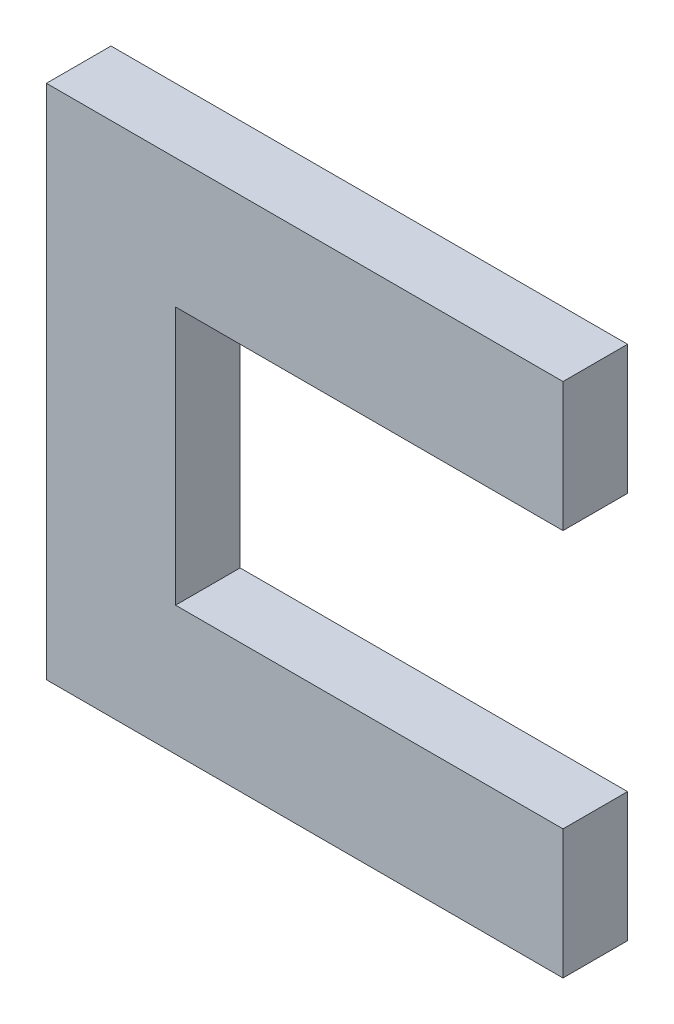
ISO-10303-21;
HEADER;
FILE_DESCRIPTION(('STEP AP214'),'2;1');
FILE_NAME('part.step','',(''),(''),'','','');
FILE_SCHEMA(('AUTOMOTIVE_DESIGN { 1 0 10303 214 1 1 1 1 }'));
ENDSEC;
DATA;
#1=APPLICATION_CONTEXT('core data for automotive mechanical design processes');
#2=APPLICATION_PROTOCOL_DEFINITION('international standard','automotive_design',2000,#1);
#3=PRODUCT_CONTEXT('',#1,'mechanical');
#4=PRODUCT('Part','Part','',(#3));
#5=PRODUCT_RELATED_PRODUCT_CATEGORY('part','',(#4));
#6=PRODUCT_DEFINITION_FORMATION('','',#4);
#7=PRODUCT_DEFINITION_CONTEXT('part definition',#1,'design');
#8=PRODUCT_DEFINITION('design','',#6,#7);
#9=PRODUCT_DEFINITION_SHAPE('','',#8);
#10=(LENGTH_UNIT() NAMED_UNIT(*) SI_UNIT(.MILLI.,.METRE.));
#11=(NAMED_UNIT(*) PLANE_ANGLE_UNIT() SI_UNIT($,.RADIAN.));
#12=(NAMED_UNIT(*) SI_UNIT($,.STERADIAN.) SOLID_ANGLE_UNIT());
#13=UNCERTAINTY_MEASURE_WITH_UNIT(LENGTH_MEASURE(1.E-05),#10,'distance_accuracy_value','');
#14=(GEOMETRIC_REPRESENTATION_CONTEXT(3) GLOBAL_UNCERTAINTY_ASSIGNED_CONTEXT((#13)) GLOBAL_UNIT_ASSIGNED_CONTEXT((#10,
#11,#12)) REPRESENTATION_CONTEXT('',''));
#15=CARTESIAN_POINT('',(0.,0.,0.));
#16=DIRECTION('',(0.,0.,1.));
#17=DIRECTION('',(1.,0.,0.));
#18=AXIS2_PLACEMENT_3D('',#15,#16,#17);
#19=CARTESIAN_POINT('',(-45.4783031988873,7.73393602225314,10.));
#20=DIRECTION('',(0.,1.,0.));
#21=DIRECTION('',(0.,0.,1.));
#22=AXIS2_PLACEMENT_3D('',#19,#20,#21);
#23=PLANE('',#22);
#24=DIRECTION('',(1.,0.,0.));
#25=VECTOR('',#24,1.);
#26=CARTESIAN_POINT('',(-45.4783031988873,7.73393602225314,0.));
#27=LINE('',#26,#25);
#28=CARTESIAN_POINT('',(-45.4783031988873,7.73393602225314,0.));
#29=VERTEX_POINT('',#28);
#30=CARTESIAN_POINT('',(14.5216968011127,7.73393602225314,0.));
#31=VERTEX_POINT('',#30);
#32=EDGE_CURVE('E120',#29,#31,#27,.T.);
#33=ORIENTED_EDGE('',*,*,#32,.T.);
#34=DIRECTION('',(0.,0.,-1.));
#35=VECTOR('',#34,1.);
#36=CARTESIAN_POINT('',(14.5216968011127,7.73393602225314,10.));
#37=LINE('',#36,#35);
#38=CARTESIAN_POINT('',(14.5216968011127,7.73393602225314,10.));
#39=VERTEX_POINT('',#38);
#40=EDGE_CURVE('E12',#39,#31,#37,.T.);
#41=ORIENTED_EDGE('',*,*,#40,.F.);
#42=DIRECTION('',(1.,0.,0.));
#43=VECTOR('',#42,1.);
#44=CARTESIAN_POINT('',(-45.4783031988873,7.73393602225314,10.));
#45=LINE('',#44,#43);
#46=CARTESIAN_POINT('',(-45.4783031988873,7.73393602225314,10.));
#47=VERTEX_POINT('',#46);
#48=EDGE_CURVE('E155',#47,#39,#45,.T.);
#49=ORIENTED_EDGE('',*,*,#48,.F.);
#50=DIRECTION('',(0.,0.,-1.));
#51=VECTOR('',#50,1.);
#52=CARTESIAN_POINT('',(-45.4783031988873,7.73393602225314,10.));
#53=LINE('',#52,#51);
#54=EDGE_CURVE('E134',#47,#29,#53,.T.);
#55=ORIENTED_EDGE('',*,*,#54,.T.);
#56=EDGE_LOOP('',(#33,#41,#49,#55));
#57=FACE_BOUND('',#56,.T.);
#58=ADVANCED_FACE('F50',(#57),#23,.F.);
#59=CARTESIAN_POINT('',(14.5216968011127,7.73393602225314,10.));
#60=DIRECTION('',(-1.,0.,0.));
#61=DIRECTION('',(0.,0.,1.));
#62=AXIS2_PLACEMENT_3D('',#59,#60,#61);
#63=PLANE('',#62);
#64=DIRECTION('',(0.,1.,0.));
#65=VECTOR('',#64,1.);
#66=CARTESIAN_POINT('',(14.5216968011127,7.73393602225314,0.));
#67=LINE('',#66,#65);
#68=CARTESIAN_POINT('',(14.5216968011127,27.7339360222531,0.));
#69=VERTEX_POINT('',#68);
#70=EDGE_CURVE('E116',#31,#69,#67,.T.);
#71=ORIENTED_EDGE('',*,*,#70,.T.);
#72=DIRECTION('',(0.,0.,-1.));
#73=VECTOR('',#72,1.);
#74=CARTESIAN_POINT('',(14.5216968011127,27.7339360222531,10.));
#75=LINE('',#74,#73);
#76=CARTESIAN_POINT('',(14.5216968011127,27.7339360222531,10.));
#77=VERTEX_POINT('',#76);
#78=EDGE_CURVE('E59',#77,#69,#75,.T.);
#79=ORIENTED_EDGE('',*,*,#78,.F.);
#80=DIRECTION('',(0.,1.,0.));
#81=VECTOR('',#80,1.);
#82=CARTESIAN_POINT('',(14.5216968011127,7.73393602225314,10.));
#83=LINE('',#82,#81);
#84=EDGE_CURVE('E130',#39,#77,#83,.T.);
#85=ORIENTED_EDGE('',*,*,#84,.F.);
#86=ORIENTED_EDGE('',*,*,#40,.T.);
#87=EDGE_LOOP('',(#71,#79,#85,#86));
#88=FACE_BOUND('',#87,.T.);
#89=ADVANCED_FACE('F129',(#88),#63,.F.);
#90=CARTESIAN_POINT('',(14.5216968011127,27.7339360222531,10.));
#91=DIRECTION('',(0.,-1.,0.));
#92=DIRECTION('',(1.,0.,0.));
#93=AXIS2_PLACEMENT_3D('',#90,#91,#92);
#94=PLANE('',#93);
#95=DIRECTION('',(-1.,0.,0.));
#96=VECTOR('',#95,1.);
#97=CARTESIAN_POINT('',(14.5216968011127,27.7339360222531,0.));
#98=LINE('',#97,#96);
#99=CARTESIAN_POINT('',(-65.4783031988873,27.7339360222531,0.));
#100=VERTEX_POINT('',#99);
#101=EDGE_CURVE('E122',#69,#100,#98,.T.);
#102=ORIENTED_EDGE('',*,*,#101,.T.);
#103=DIRECTION('',(0.,0.,-1.));
#104=VECTOR('',#103,1.);
#105=CARTESIAN_POINT('',(-65.4783031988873,27.7339360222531,10.));
#106=LINE('',#105,#104);
#107=CARTESIAN_POINT('',(-65.4783031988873,27.7339360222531,10.));
#108=VERTEX_POINT('',#107);
#109=EDGE_CURVE('E275',#108,#100,#106,.T.);
#110=ORIENTED_EDGE('',*,*,#109,.F.);
#111=DIRECTION('',(-1.,0.,0.));
#112=VECTOR('',#111,1.);
#113=CARTESIAN_POINT('',(14.5216968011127,27.7339360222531,10.));
#114=LINE('',#113,#112);
#115=EDGE_CURVE('E241',#77,#108,#114,.T.);
#116=ORIENTED_EDGE('',*,*,#115,.F.);
#117=ORIENTED_EDGE('',*,*,#78,.T.);
#118=EDGE_LOOP('',(#102,#110,#116,#117));
#119=FACE_BOUND('',#118,.T.);
#120=ADVANCED_FACE('F330',(#119),#94,.F.);
#121=CARTESIAN_POINT('',(-65.4783031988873,27.7339360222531,10.));
#122=DIRECTION('',(1.,0.,0.));
#123=DIRECTION('',(0.,0.,-1.));
#124=AXIS2_PLACEMENT_3D('',#121,#122,#123);
#125=PLANE('',#124);
#126=DIRECTION('',(0.,-1.,0.));
#127=VECTOR('',#126,1.);
#128=CARTESIAN_POINT('',(-65.4783031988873,27.7339360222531,0.));
#129=LINE('',#128,#127);
#130=CARTESIAN_POINT('',(-65.4783031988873,-52.2660639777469,0.));
#131=VERTEX_POINT('',#130);
#132=EDGE_CURVE('E257',#100,#131,#129,.T.);
#133=ORIENTED_EDGE('',*,*,#132,.T.);
#134=DIRECTION('',(0.,0.,-1.));
#135=VECTOR('',#134,1.);
#136=CARTESIAN_POINT('',(-65.4783031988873,-52.2660639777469,10.));
#137=LINE('',#136,#135);
#138=CARTESIAN_POINT('',(-65.4783031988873,-52.2660639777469,10.));
#139=VERTEX_POINT('',#138);
#140=EDGE_CURVE('E279',#139,#131,#137,.T.);
#141=ORIENTED_EDGE('',*,*,#140,.F.);
#142=DIRECTION('',(0.,-1.,0.));
#143=VECTOR('',#142,1.);
#144=CARTESIAN_POINT('',(-65.4783031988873,27.7339360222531,10.));
#145=LINE('',#144,#143);
#146=EDGE_CURVE('E238',#108,#139,#145,.T.);
#147=ORIENTED_EDGE('',*,*,#146,.F.);
#148=ORIENTED_EDGE('',*,*,#109,.T.);
#149=EDGE_LOOP('',(#133,#141,#147,#148));
#150=FACE_BOUND('',#149,.T.);
#151=ADVANCED_FACE('F317',(#150),#125,.F.);
#152=CARTESIAN_POINT('',(-65.4783031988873,-52.2660639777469,10.));
#153=DIRECTION('',(0.,1.,0.));
#154=DIRECTION('',(-1.,0.,0.));
#155=AXIS2_PLACEMENT_3D('',#152,#153,#154);
#156=PLANE('',#155);
#157=DIRECTION('',(1.,0.,0.));
#158=VECTOR('',#157,1.);
#159=CARTESIAN_POINT('',(-65.4783031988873,-52.2660639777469,0.));
#160=LINE('',#159,#158);
#161=CARTESIAN_POINT('',(14.5216968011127,-52.2660639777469,0.));
#162=VERTEX_POINT('',#161);
#163=EDGE_CURVE('E253',#131,#162,#160,.T.);
#164=ORIENTED_EDGE('',*,*,#163,.T.);
#165=DIRECTION('',(0.,0.,-1.));
#166=VECTOR('',#165,1.);
#167=CARTESIAN_POINT('',(14.5216968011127,-52.2660639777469,10.));
#168=LINE('',#167,#166);
#169=CARTESIAN_POINT('',(14.5216968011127,-52.2660639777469,10.));
#170=VERTEX_POINT('',#169);
#171=EDGE_CURVE('E290',#170,#162,#168,.T.);
#172=ORIENTED_EDGE('',*,*,#171,.F.);
#173=DIRECTION('',(1.,0.,0.));
#174=VECTOR('',#173,1.);
#175=CARTESIAN_POINT('',(-65.4783031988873,-52.2660639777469,10.));
#176=LINE('',#175,#174);
#177=EDGE_CURVE('E231',#139,#170,#176,.T.);
#178=ORIENTED_EDGE('',*,*,#177,.F.);
#179=ORIENTED_EDGE('',*,*,#140,.T.);
#180=EDGE_LOOP('',(#164,#172,#178,#179));
#181=FACE_BOUND('',#180,.T.);
#182=ADVANCED_FACE('F322',(#181),#156,.F.);
#183=CARTESIAN_POINT('',(14.5216968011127,-52.2660639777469,10.));
#184=DIRECTION('',(-1.,0.,0.));
#185=DIRECTION('',(0.,0.,1.));
#186=AXIS2_PLACEMENT_3D('',#183,#184,#185);
#187=PLANE('',#186);
#188=DIRECTION('',(0.,1.,0.));
#189=VECTOR('',#188,1.);
#190=CARTESIAN_POINT('',(14.5216968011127,-52.2660639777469,0.));
#191=LINE('',#190,#189);
#192=CARTESIAN_POINT('',(14.5216968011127,-32.2660639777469,0.));
#193=VERTEX_POINT('',#192);
#194=EDGE_CURVE('E181',#162,#193,#191,.T.);
#195=ORIENTED_EDGE('',*,*,#194,.T.);
#196=DIRECTION('',(0.,0.,-1.));
#197=VECTOR('',#196,1.);
#198=CARTESIAN_POINT('',(14.5216968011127,-32.2660639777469,10.));
#199=LINE('',#198,#197);
#200=CARTESIAN_POINT('',(14.5216968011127,-32.2660639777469,10.));
#201=VERTEX_POINT('',#200);
#202=EDGE_CURVE('E201',#201,#193,#199,.T.);
#203=ORIENTED_EDGE('',*,*,#202,.F.);
#204=DIRECTION('',(0.,1.,0.));
#205=VECTOR('',#204,1.);
#206=CARTESIAN_POINT('',(14.5216968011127,-52.2660639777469,10.));
#207=LINE('',#206,#205);
#208=EDGE_CURVE('E228',#170,#201,#207,.T.);
#209=ORIENTED_EDGE('',*,*,#208,.F.);
#210=ORIENTED_EDGE('',*,*,#171,.T.);
#211=EDGE_LOOP('',(#195,#203,#209,#210));
#212=FACE_BOUND('',#211,.T.);
#213=ADVANCED_FACE('F359',(#212),#187,.F.);
#214=CARTESIAN_POINT('',(14.5216968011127,-32.2660639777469,10.));
#215=DIRECTION('',(0.,-1.,0.));
#216=DIRECTION('',(1.,0.,0.));
#217=AXIS2_PLACEMENT_3D('',#214,#215,#216);
#218=PLANE('',#217);
#219=DIRECTION('',(-1.,0.,0.));
#220=VECTOR('',#219,1.);
#221=CARTESIAN_POINT('',(14.5216968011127,-32.2660639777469,0.));
#222=LINE('',#221,#220);
#223=CARTESIAN_POINT('',(-45.4783031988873,-32.2660639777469,0.));
#224=VERTEX_POINT('',#223);
#225=EDGE_CURVE('E178',#193,#224,#222,.T.);
#226=ORIENTED_EDGE('',*,*,#225,.T.);
#227=DIRECTION('',(0.,0.,-1.));
#228=VECTOR('',#227,1.);
#229=CARTESIAN_POINT('',(-45.4783031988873,-32.2660639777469,10.));
#230=LINE('',#229,#228);
#231=CARTESIAN_POINT('',(-45.4783031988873,-32.2660639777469,10.));
#232=VERTEX_POINT('',#231);
#233=EDGE_CURVE('E196',#232,#224,#230,.T.);
#234=ORIENTED_EDGE('',*,*,#233,.F.);
#235=DIRECTION('',(-1.,0.,0.));
#236=VECTOR('',#235,1.);
#237=CARTESIAN_POINT('',(14.5216968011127,-32.2660639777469,10.));
#238=LINE('',#237,#236);
#239=EDGE_CURVE('E71',#201,#232,#238,.T.);
#240=ORIENTED_EDGE('',*,*,#239,.F.);
#241=ORIENTED_EDGE('',*,*,#202,.T.);
#242=EDGE_LOOP('',(#226,#234,#240,#241));
#243=FACE_BOUND('',#242,.T.);
#244=ADVANCED_FACE('F308',(#243),#218,.F.);
#245=CARTESIAN_POINT('',(-45.4783031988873,-32.2660639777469,10.));
#246=DIRECTION('',(-1.,0.,0.));
#247=DIRECTION('',(0.,0.,1.));
#248=AXIS2_PLACEMENT_3D('',#245,#246,#247);
#249=PLANE('',#248);
#250=DIRECTION('',(0.,1.,0.));
#251=VECTOR('',#250,1.);
#252=CARTESIAN_POINT('',(-45.4783031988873,-32.2660639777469,0.));
#253=LINE('',#252,#251);
#254=EDGE_CURVE('E160',#224,#29,#253,.T.);
#255=ORIENTED_EDGE('',*,*,#254,.T.);
#256=ORIENTED_EDGE('',*,*,#54,.F.);
#257=DIRECTION('',(0.,1.,0.));
#258=VECTOR('',#257,1.);
#259=CARTESIAN_POINT('',(-45.4783031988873,-32.2660639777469,10.));
#260=LINE('',#259,#258);
#261=EDGE_CURVE('E66',#232,#47,#260,.T.);
#262=ORIENTED_EDGE('',*,*,#261,.F.);
#263=ORIENTED_EDGE('',*,*,#233,.T.);
#264=EDGE_LOOP('',(#255,#256,#262,#263));
#265=FACE_BOUND('',#264,.T.);
#266=ADVANCED_FACE('F374',(#265),#249,.F.);
#267=CARTESIAN_POINT('',(14.5216968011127,7.73393602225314,10.));
#268=DIRECTION('',(0.,0.,1.));
#269=DIRECTION('',(1.,0.,0.));
#270=AXIS2_PLACEMENT_3D('',#267,#268,#269);
#271=PLANE('',#270);
#272=ORIENTED_EDGE('',*,*,#48,.T.);
#273=ORIENTED_EDGE('',*,*,#84,.T.);
#274=ORIENTED_EDGE('',*,*,#115,.T.);
#275=ORIENTED_EDGE('',*,*,#146,.T.);
#276=ORIENTED_EDGE('',*,*,#177,.T.);
#277=ORIENTED_EDGE('',*,*,#208,.T.);
#278=ORIENTED_EDGE('',*,*,#239,.T.);
#279=ORIENTED_EDGE('',*,*,#261,.T.);
#280=EDGE_LOOP('',(#272,#273,#274,#275,#276,#277,#278,#279));
#281=FACE_BOUND('',#280,.T.);
#282=ADVANCED_FACE('F326',(#281),#271,.T.);
#283=CARTESIAN_POINT('',(14.5216968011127,7.73393602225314,0.));
#284=DIRECTION('',(0.,0.,1.));
#285=DIRECTION('',(1.,0.,0.));
#286=AXIS2_PLACEMENT_3D('',#283,#284,#285);
#287=PLANE('',#286);
#288=ORIENTED_EDGE('',*,*,#32,.F.);
#289=ORIENTED_EDGE('',*,*,#254,.F.);
#290=ORIENTED_EDGE('',*,*,#225,.F.);
#291=ORIENTED_EDGE('',*,*,#194,.F.);
#292=ORIENTED_EDGE('',*,*,#163,.F.);
#293=ORIENTED_EDGE('',*,*,#132,.F.);
#294=ORIENTED_EDGE('',*,*,#101,.F.);
#295=ORIENTED_EDGE('',*,*,#70,.F.);
#296=EDGE_LOOP('',(#288,#289,#290,#291,#292,#293,#294,#295));
#297=FACE_BOUND('',#296,.T.);
#298=ADVANCED_FACE('F117',(#297),#287,.F.);
#299=CLOSED_SHELL('',(#58,#89,#120,#151,#182,#213,#244,#266,#282,#298));
#300=MANIFOLD_SOLID_BREP('B2',#299);
#301=ADVANCED_BREP_SHAPE_REPRESENTATION('',(#18,#300),#14);
#302=SHAPE_DEFINITION_REPRESENTATION(#9,#301);
ENDSEC;
END-ISO-10303-21;
